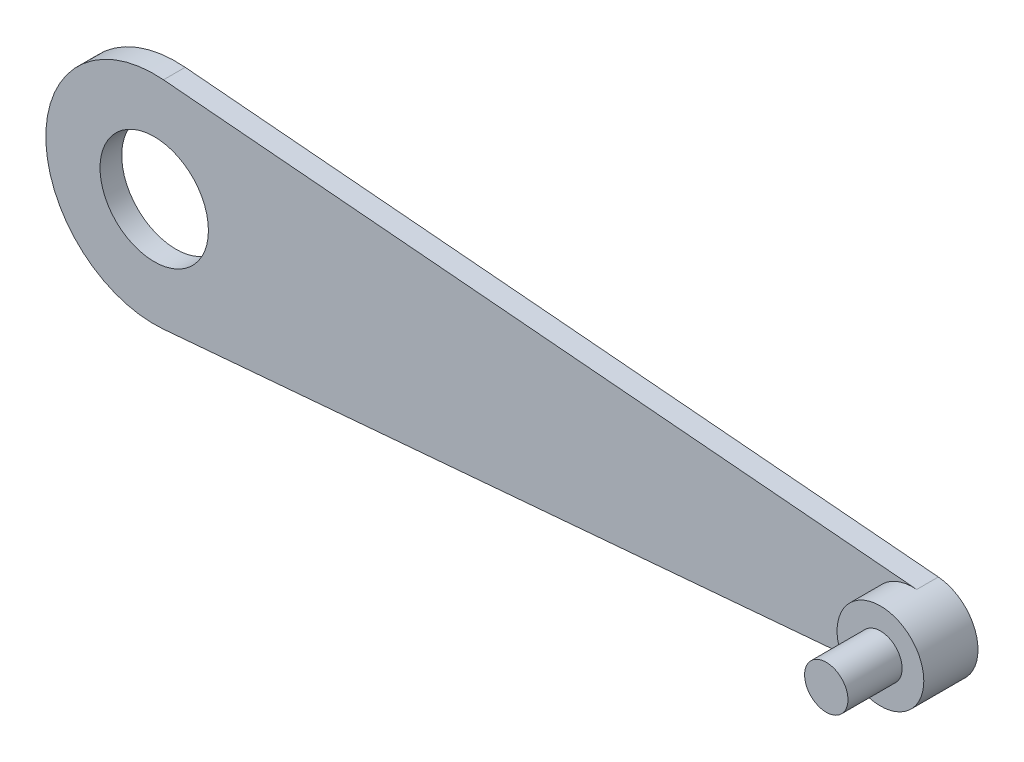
ISO-10303-21;
HEADER;
FILE_DESCRIPTION(('STEP AP214'),'2;1');
FILE_NAME('part.step','',(''),(''),'','','');
FILE_SCHEMA(('AUTOMOTIVE_DESIGN { 1 0 10303 214 1 1 1 1 }'));
ENDSEC;
DATA;
#1=APPLICATION_CONTEXT('core data for automotive mechanical design processes');
#2=APPLICATION_PROTOCOL_DEFINITION('international standard','automotive_design',2000,#1);
#3=PRODUCT_CONTEXT('',#1,'mechanical');
#4=PRODUCT('Part','Part','',(#3));
#5=PRODUCT_RELATED_PRODUCT_CATEGORY('part','',(#4));
#6=PRODUCT_DEFINITION_FORMATION('','',#4);
#7=PRODUCT_DEFINITION_CONTEXT('part definition',#1,'design');
#8=PRODUCT_DEFINITION('design','',#6,#7);
#9=PRODUCT_DEFINITION_SHAPE('','',#8);
#10=(LENGTH_UNIT() NAMED_UNIT(*) SI_UNIT(.MILLI.,.METRE.));
#11=(NAMED_UNIT(*) PLANE_ANGLE_UNIT() SI_UNIT($,.RADIAN.));
#12=(NAMED_UNIT(*) SI_UNIT($,.STERADIAN.) SOLID_ANGLE_UNIT());
#13=UNCERTAINTY_MEASURE_WITH_UNIT(LENGTH_MEASURE(1.E-05),#10,'distance_accuracy_value','');
#14=(GEOMETRIC_REPRESENTATION_CONTEXT(3) GLOBAL_UNCERTAINTY_ASSIGNED_CONTEXT((#13)) GLOBAL_UNIT_ASSIGNED_CONTEXT((#10,
#11,#12)) REPRESENTATION_CONTEXT('',''));
#15=CARTESIAN_POINT('',(0.,0.,0.));
#16=DIRECTION('',(0.,0.,1.));
#17=DIRECTION('',(1.,0.,0.));
#18=AXIS2_PLACEMENT_3D('',#15,#16,#17);
#19=CARTESIAN_POINT('',(0.,0.,1.));
#20=DIRECTION('',(0.,0.,-1.));
#21=DIRECTION('',(-1.,0.,0.));
#22=AXIS2_PLACEMENT_3D('',#19,#20,#21);
#23=CYLINDRICAL_SURFACE('',#22,5.);
#24=DIRECTION('',(0.,0.,-1.));
#25=VECTOR('',#24,1.);
#26=CARTESIAN_POINT('',(0.428571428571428,-4.98159879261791,1.));
#27=LINE('',#26,#25);
#28=CARTESIAN_POINT('',(0.428571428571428,-4.98159879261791,1.));
#29=VERTEX_POINT('',#28);
#30=CARTESIAN_POINT('',(0.428571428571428,-4.98159879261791,0.));
#31=VERTEX_POINT('',#30);
#32=EDGE_CURVE('E49',#29,#31,#27,.T.);
#33=ORIENTED_EDGE('',*,*,#32,.F.);
#34=CARTESIAN_POINT('',(0.,0.,1.));
#35=DIRECTION('',(0.,0.,1.));
#36=DIRECTION('',(1.,0.,0.));
#37=AXIS2_PLACEMENT_3D('',#34,#35,#36);
#38=CIRCLE('',#37,5.);
#39=CARTESIAN_POINT('',(0.428571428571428,4.98159879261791,1.));
#40=VERTEX_POINT('',#39);
#41=EDGE_CURVE('E11',#40,#29,#38,.T.);
#42=ORIENTED_EDGE('',*,*,#41,.F.);
#43=DIRECTION('',(0.,0.,-1.));
#44=VECTOR('',#43,1.);
#45=CARTESIAN_POINT('',(0.428571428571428,4.98159879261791,1.));
#46=LINE('',#45,#44);
#47=CARTESIAN_POINT('',(0.428571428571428,4.98159879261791,0.));
#48=VERTEX_POINT('',#47);
#49=EDGE_CURVE('E103',#40,#48,#46,.T.);
#50=ORIENTED_EDGE('',*,*,#49,.T.);
#51=CARTESIAN_POINT('',(0.,0.,0.));
#52=DIRECTION('',(0.,0.,1.));
#53=DIRECTION('',(1.,0.,0.));
#54=AXIS2_PLACEMENT_3D('',#51,#52,#53);
#55=CIRCLE('',#54,5.);
#56=EDGE_CURVE('E38',#48,#31,#55,.T.);
#57=ORIENTED_EDGE('',*,*,#56,.T.);
#58=EDGE_LOOP('',(#33,#42,#50,#57));
#59=FACE_BOUND('',#58,.T.);
#60=ADVANCED_FACE('F31',(#59),#23,.T.);
#61=CARTESIAN_POINT('',(0.,0.,1.));
#62=DIRECTION('',(0.,0.,1.));
#63=DIRECTION('',(1.,0.,0.));
#64=AXIS2_PLACEMENT_3D('',#61,#62,#63);
#65=PLANE('',#64);
#66=ORIENTED_EDGE('',*,*,#41,.T.);
#67=DIRECTION('',(0.996319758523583,0.0857142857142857,0.));
#68=VECTOR('',#67,1.);
#69=CARTESIAN_POINT('',(0.428571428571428,-4.98159879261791,1.));
#70=LINE('',#69,#68);
#71=CARTESIAN_POINT('',(35.1714285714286,-1.99263951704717,1.));
#72=VERTEX_POINT('',#71);
#73=EDGE_CURVE('E93',#29,#72,#70,.T.);
#74=ORIENTED_EDGE('',*,*,#73,.T.);
#75=CARTESIAN_POINT('',(35.,0.,1.));
#76=DIRECTION('',(0.,0.,-1.));
#77=DIRECTION('',(1.,0.,0.));
#78=AXIS2_PLACEMENT_3D('',#75,#76,#77);
#79=CIRCLE('',#78,2.);
#80=CARTESIAN_POINT('',(35.1714285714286,1.99263951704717,1.));
#81=VERTEX_POINT('',#80);
#82=EDGE_CURVE('E74',#72,#81,#79,.T.);
#83=ORIENTED_EDGE('',*,*,#82,.T.);
#84=DIRECTION('',(-0.996319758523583,0.0857142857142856,0.));
#85=VECTOR('',#84,1.);
#86=CARTESIAN_POINT('',(0.428571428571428,4.98159879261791,1.));
#87=LINE('',#86,#85);
#88=EDGE_CURVE('E100',#81,#40,#87,.T.);
#89=ORIENTED_EDGE('',*,*,#88,.T.);
#90=EDGE_LOOP('',(#66,#74,#83,#89));
#91=FACE_BOUND('',#90,.T.);
#92=CARTESIAN_POINT('',(0.,0.,1.));
#93=DIRECTION('',(0.,0.,1.));
#94=DIRECTION('',(1.,0.,0.));
#95=AXIS2_PLACEMENT_3D('',#92,#93,#94);
#96=CIRCLE('',#95,2.5);
#97=CARTESIAN_POINT('',(2.5,0.,1.));
#98=VERTEX_POINT('',#97);
#99=EDGE_CURVE('E110',#98,#98,#96,.T.);
#100=ORIENTED_EDGE('',*,*,#99,.F.);
#101=EDGE_LOOP('',(#100));
#102=FACE_BOUND('',#101,.T.);
#103=ADVANCED_FACE('F117',(#91,#102),#65,.T.);
#104=CARTESIAN_POINT('',(0.,0.,0.));
#105=DIRECTION('',(0.,0.,1.));
#106=DIRECTION('',(1.,0.,0.));
#107=AXIS2_PLACEMENT_3D('',#104,#105,#106);
#108=PLANE('',#107);
#109=ORIENTED_EDGE('',*,*,#56,.F.);
#110=DIRECTION('',(-0.996319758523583,0.0857142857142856,0.));
#111=VECTOR('',#110,1.);
#112=CARTESIAN_POINT('',(0.428571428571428,4.98159879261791,0.));
#113=LINE('',#112,#111);
#114=CARTESIAN_POINT('',(35.1714285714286,1.99263951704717,0.));
#115=VERTEX_POINT('',#114);
#116=EDGE_CURVE('E87',#115,#48,#113,.T.);
#117=ORIENTED_EDGE('',*,*,#116,.F.);
#118=CARTESIAN_POINT('',(35.,0.,0.));
#119=DIRECTION('',(0.,0.,1.));
#120=DIRECTION('',(1.,0.,0.));
#121=AXIS2_PLACEMENT_3D('',#118,#119,#120);
#122=CIRCLE('',#121,2.);
#123=CARTESIAN_POINT('',(35.1714285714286,-1.99263951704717,0.));
#124=VERTEX_POINT('',#123);
#125=EDGE_CURVE('E71',#124,#115,#122,.T.);
#126=ORIENTED_EDGE('',*,*,#125,.F.);
#127=DIRECTION('',(0.996319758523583,0.0857142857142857,0.));
#128=VECTOR('',#127,1.);
#129=CARTESIAN_POINT('',(0.428571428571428,-4.98159879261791,0.));
#130=LINE('',#129,#128);
#131=EDGE_CURVE('E85',#31,#124,#130,.T.);
#132=ORIENTED_EDGE('',*,*,#131,.F.);
#133=EDGE_LOOP('',(#109,#117,#126,#132));
#134=FACE_BOUND('',#133,.T.);
#135=CARTESIAN_POINT('',(0.,0.,0.));
#136=DIRECTION('',(0.,0.,1.));
#137=DIRECTION('',(1.,0.,0.));
#138=AXIS2_PLACEMENT_3D('',#135,#136,#137);
#139=CIRCLE('',#138,2.5);
#140=CARTESIAN_POINT('',(2.5,0.,0.));
#141=VERTEX_POINT('',#140);
#142=EDGE_CURVE('E107',#141,#141,#139,.T.);
#143=ORIENTED_EDGE('',*,*,#142,.T.);
#144=EDGE_LOOP('',(#143));
#145=FACE_BOUND('',#144,.T.);
#146=ADVANCED_FACE('F83',(#134,#145),#108,.F.);
#147=CARTESIAN_POINT('',(0.,0.,1.));
#148=DIRECTION('',(0.,0.,-1.));
#149=DIRECTION('',(-1.,0.,0.));
#150=AXIS2_PLACEMENT_3D('',#147,#148,#149);
#151=CYLINDRICAL_SURFACE('',#150,2.5);
#152=ORIENTED_EDGE('',*,*,#99,.T.);
#153=EDGE_LOOP('',(#152));
#154=FACE_BOUND('',#153,.T.);
#155=ORIENTED_EDGE('',*,*,#142,.F.);
#156=EDGE_LOOP('',(#155));
#157=FACE_BOUND('',#156,.T.);
#158=ADVANCED_FACE('F114',(#154,#157),#151,.F.);
#159=CARTESIAN_POINT('',(0.428571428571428,-4.98159879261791,1.));
#160=DIRECTION('',(-0.0857142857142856,0.996319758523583,0.));
#161=DIRECTION('',(-0.996319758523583,-0.0857142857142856,0.));
#162=AXIS2_PLACEMENT_3D('',#159,#160,#161);
#163=PLANE('',#162);
#164=ORIENTED_EDGE('',*,*,#131,.T.);
#165=DIRECTION('',(0.,0.,-1.));
#166=VECTOR('',#165,1.);
#167=CARTESIAN_POINT('',(35.1714285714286,-1.99263951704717,1.));
#168=LINE('',#167,#166);
#169=EDGE_CURVE('E67',#72,#124,#168,.T.);
#170=ORIENTED_EDGE('',*,*,#169,.F.);
#171=ORIENTED_EDGE('',*,*,#73,.F.);
#172=ORIENTED_EDGE('',*,*,#32,.T.);
#173=EDGE_LOOP('',(#164,#170,#171,#172));
#174=FACE_BOUND('',#173,.T.);
#175=ADVANCED_FACE('F91',(#174),#163,.F.);
#176=CARTESIAN_POINT('',(0.428571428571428,4.98159879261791,1.));
#177=DIRECTION('',(-0.0857142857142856,-0.996319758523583,0.));
#178=DIRECTION('',(0.996319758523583,-0.0857142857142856,0.));
#179=AXIS2_PLACEMENT_3D('',#176,#177,#178);
#180=PLANE('',#179);
#181=ORIENTED_EDGE('',*,*,#116,.T.);
#182=ORIENTED_EDGE('',*,*,#49,.F.);
#183=ORIENTED_EDGE('',*,*,#88,.F.);
#184=DIRECTION('',(0.,0.,-1.));
#185=VECTOR('',#184,1.);
#186=CARTESIAN_POINT('',(35.1714285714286,1.99263951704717,1.));
#187=LINE('',#186,#185);
#188=EDGE_CURVE('E79',#81,#115,#187,.T.);
#189=ORIENTED_EDGE('',*,*,#188,.T.);
#190=EDGE_LOOP('',(#181,#182,#183,#189));
#191=FACE_BOUND('',#190,.T.);
#192=ADVANCED_FACE('F130',(#191),#180,.F.);
#193=CARTESIAN_POINT('',(35.,0.,2.5));
#194=DIRECTION('',(0.,0.,1.));
#195=DIRECTION('',(1.,0.,0.));
#196=AXIS2_PLACEMENT_3D('',#193,#194,#195);
#197=PLANE('',#196);
#198=CARTESIAN_POINT('',(35.,0.,2.5));
#199=DIRECTION('',(0.,0.,1.));
#200=DIRECTION('',(1.,0.,0.));
#201=AXIS2_PLACEMENT_3D('',#198,#199,#200);
#202=CIRCLE('',#201,2.);
#203=CARTESIAN_POINT('',(37.,0.,2.5));
#204=VERTEX_POINT('',#203);
#205=EDGE_CURVE('E88',#204,#204,#202,.T.);
#206=ORIENTED_EDGE('',*,*,#205,.T.);
#207=EDGE_LOOP('',(#206));
#208=FACE_BOUND('',#207,.T.);
#209=CARTESIAN_POINT('',(35.,0.,2.5));
#210=DIRECTION('',(0.,0.,1.));
#211=DIRECTION('',(1.,0.,0.));
#212=AXIS2_PLACEMENT_3D('',#209,#210,#211);
#213=CIRCLE('',#212,0.999999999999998);
#214=CARTESIAN_POINT('',(36.,0.,2.5));
#215=VERTEX_POINT('',#214);
#216=EDGE_CURVE('E151',#215,#215,#213,.T.);
#217=ORIENTED_EDGE('',*,*,#216,.F.);
#218=EDGE_LOOP('',(#217));
#219=FACE_BOUND('',#218,.T.);
#220=ADVANCED_FACE('F133',(#208,#219),#197,.T.);
#221=CARTESIAN_POINT('',(35.,0.,2.5));
#222=DIRECTION('',(0.,0.,-1.));
#223=DIRECTION('',(-1.,0.,0.));
#224=AXIS2_PLACEMENT_3D('',#221,#222,#223);
#225=CYLINDRICAL_SURFACE('',#224,2.);
#226=ORIENTED_EDGE('',*,*,#169,.T.);
#227=ORIENTED_EDGE('',*,*,#125,.T.);
#228=ORIENTED_EDGE('',*,*,#188,.F.);
#229=ORIENTED_EDGE('',*,*,#82,.F.);
#230=EDGE_LOOP('',(#226,#227,#228,#229));
#231=FACE_BOUND('',#230,.T.);
#232=ORIENTED_EDGE('',*,*,#205,.F.);
#233=EDGE_LOOP('',(#232));
#234=FACE_BOUND('',#233,.T.);
#235=ADVANCED_FACE('F69',(#231,#234),#225,.T.);
#236=CARTESIAN_POINT('',(35.,0.,5.));
#237=DIRECTION('',(0.,0.,-1.));
#238=DIRECTION('',(-1.,0.,0.));
#239=AXIS2_PLACEMENT_3D('',#236,#237,#238);
#240=CYLINDRICAL_SURFACE('',#239,0.999999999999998);
#241=CARTESIAN_POINT('',(35.,0.,5.));
#242=DIRECTION('',(0.,0.,1.));
#243=DIRECTION('',(1.,0.,0.));
#244=AXIS2_PLACEMENT_3D('',#241,#242,#243);
#245=CIRCLE('',#244,0.999999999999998);
#246=CARTESIAN_POINT('',(36.,0.,5.));
#247=VERTEX_POINT('',#246);
#248=EDGE_CURVE('E89',#247,#247,#245,.T.);
#249=ORIENTED_EDGE('',*,*,#248,.F.);
#250=EDGE_LOOP('',(#249));
#251=FACE_BOUND('',#250,.T.);
#252=ORIENTED_EDGE('',*,*,#216,.T.);
#253=EDGE_LOOP('',(#252));
#254=FACE_BOUND('',#253,.T.);
#255=ADVANCED_FACE('F137',(#251,#254),#240,.T.);
#256=CARTESIAN_POINT('',(35.,0.,5.));
#257=DIRECTION('',(0.,0.,1.));
#258=DIRECTION('',(1.,0.,0.));
#259=AXIS2_PLACEMENT_3D('',#256,#257,#258);
#260=PLANE('',#259);
#261=ORIENTED_EDGE('',*,*,#248,.T.);
#262=EDGE_LOOP('',(#261));
#263=FACE_BOUND('',#262,.T.);
#264=ADVANCED_FACE('F143',(#263),#260,.T.);
#265=CLOSED_SHELL('',(#60,#103,#146,#158,#175,#192,#220,#235,#255,#264));
#266=MANIFOLD_SOLID_BREP('B2',#265);
#267=ADVANCED_BREP_SHAPE_REPRESENTATION('',(#18,#266),#14);
#268=SHAPE_DEFINITION_REPRESENTATION(#9,#267);
ENDSEC;
END-ISO-10303-21;
